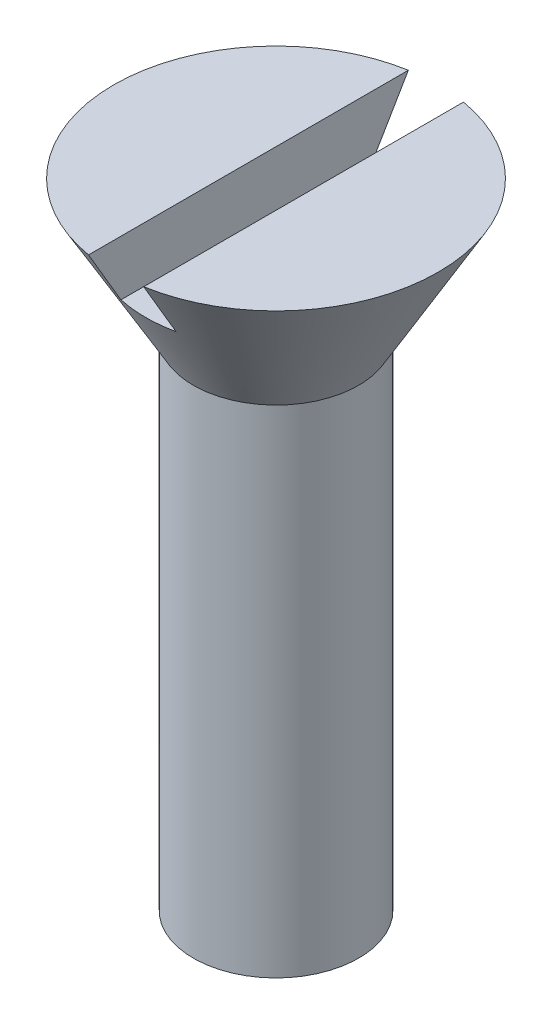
ISO-10303-21;
HEADER;
FILE_DESCRIPTION(('STEP AP214'),'2;1');
FILE_NAME('part.step','',(''),(''),'','','');
FILE_SCHEMA(('AUTOMOTIVE_DESIGN { 1 0 10303 214 1 1 1 1 }'));
ENDSEC;
DATA;
#1=APPLICATION_CONTEXT('core data for automotive mechanical design processes');
#2=APPLICATION_PROTOCOL_DEFINITION('international standard','automotive_design',2000,#1);
#3=PRODUCT_CONTEXT('',#1,'mechanical');
#4=PRODUCT('Part','Part','',(#3));
#5=PRODUCT_RELATED_PRODUCT_CATEGORY('part','',(#4));
#6=PRODUCT_DEFINITION_FORMATION('','',#4);
#7=PRODUCT_DEFINITION_CONTEXT('part definition',#1,'design');
#8=PRODUCT_DEFINITION('design','',#6,#7);
#9=PRODUCT_DEFINITION_SHAPE('','',#8);
#10=(LENGTH_UNIT() NAMED_UNIT(*) SI_UNIT(.MILLI.,.METRE.));
#11=(NAMED_UNIT(*) PLANE_ANGLE_UNIT() SI_UNIT($,.RADIAN.));
#12=(NAMED_UNIT(*) SI_UNIT($,.STERADIAN.) SOLID_ANGLE_UNIT());
#13=UNCERTAINTY_MEASURE_WITH_UNIT(LENGTH_MEASURE(1.E-05),#10,'distance_accuracy_value','');
#14=(GEOMETRIC_REPRESENTATION_CONTEXT(3) GLOBAL_UNCERTAINTY_ASSIGNED_CONTEXT((#13)) GLOBAL_UNIT_ASSIGNED_CONTEXT((#10,
#11,#12)) REPRESENTATION_CONTEXT('',''));
#15=CARTESIAN_POINT('',(0.,0.,0.));
#16=DIRECTION('',(0.,0.,1.));
#17=DIRECTION('',(1.,0.,0.));
#18=AXIS2_PLACEMENT_3D('',#15,#16,#17);
#19=CARTESIAN_POINT('',(5.88675134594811,24.7320508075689,0.));
#20=DIRECTION('',(0.,-1.,0.));
#21=DIRECTION('',(1.,0.,0.));
#22=AXIS2_PLACEMENT_3D('',#19,#20,#21);
#23=PLANE('',#22);
#24=CARTESIAN_POINT('',(0.,24.7320508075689,0.));
#25=DIRECTION('',(0.,1.,0.));
#26=DIRECTION('',(-1.,0.,0.));
#27=AXIS2_PLACEMENT_3D('',#24,#25,#26);
#28=CIRCLE('',#27,5.88675134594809);
#29=CARTESIAN_POINT('',(1.00000000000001,24.7320508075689,5.80119310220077));
#30=VERTEX_POINT('',#29);
#31=CARTESIAN_POINT('',(1.00000000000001,24.7320508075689,-5.80119310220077));
#32=VERTEX_POINT('',#31);
#33=EDGE_CURVE('E85',#30,#32,#28,.T.);
#34=ORIENTED_EDGE('',*,*,#33,.T.);
#35=DIRECTION('',(0.,0.,-1.));
#36=VECTOR('',#35,1.);
#37=CARTESIAN_POINT('',(1.00000000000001,24.7320508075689,7.20359485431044));
#38=LINE('',#37,#36);
#39=EDGE_CURVE('E78',#30,#32,#38,.T.);
#40=ORIENTED_EDGE('',*,*,#39,.F.);
#41=EDGE_LOOP('',(#34,#40));
#42=FACE_BOUND('',#41,.T.);
#43=ADVANCED_FACE('F32',(#42),#23,.F.);
#44=CARTESIAN_POINT('',(-1.00000000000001,24.7320508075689,-5.80119310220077));
#45=VERTEX_POINT('',#44);
#46=CARTESIAN_POINT('',(-0.999999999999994,24.7320508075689,5.80119310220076));
#47=VERTEX_POINT('',#46);
#48=EDGE_CURVE('E92',#45,#47,#28,.T.);
#49=ORIENTED_EDGE('',*,*,#48,.T.);
#50=DIRECTION('',(0.,0.,1.));
#51=VECTOR('',#50,1.);
#52=CARTESIAN_POINT('',(-0.999999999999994,24.7320508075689,7.20359485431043));
#53=LINE('',#52,#51);
#54=EDGE_CURVE('E86',#45,#47,#53,.T.);
#55=ORIENTED_EDGE('',*,*,#54,.F.);
#56=EDGE_LOOP('',(#49,#55));
#57=FACE_BOUND('',#56,.T.);
#58=ADVANCED_FACE('F34',(#57),#23,.F.);
#59=CARTESIAN_POINT('',(0.,19.7320508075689,0.));
#60=DIRECTION('',(0.,1.,0.));
#61=DIRECTION('',(-1.,0.,0.));
#62=AXIS2_PLACEMENT_3D('',#59,#60,#61);
#63=CONICAL_SURFACE('',#62,3.,0.523598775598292);
#64=ORIENTED_EDGE('',*,*,#33,.F.);
#65=CARTESIAN_POINT('',(1.,31.8975513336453,9.97374876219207));
#66=CARTESIAN_POINT('',(1.00000000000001,31.4187306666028,9.69591018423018));
#67=CARTESIAN_POINT('',(1.00000000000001,30.9399557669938,9.41799266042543));
#68=CARTESIAN_POINT('',(1.00000000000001,29.9825363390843,8.86193069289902));
#69=CARTESIAN_POINT('',(1.00000000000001,29.5038918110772,8.58378624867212));
#70=CARTESIAN_POINT('',(1.00000000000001,28.5466949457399,8.02715662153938));
#71=CARTESIAN_POINT('',(1.00000000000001,28.0681426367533,7.74867138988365));
#72=CARTESIAN_POINT('',(1.00000000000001,27.1112750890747,7.19129594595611));
#73=CARTESIAN_POINT('',(1.00000000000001,26.6329598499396,6.91240573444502));
#74=CARTESIAN_POINT('',(1.00000000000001,25.6710643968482,6.3507813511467));
#75=CARTESIAN_POINT('',(1.00000000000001,25.1874881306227,6.06804041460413));
#76=CARTESIAN_POINT('',(1.00000000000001,24.2208498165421,5.5016744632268));
#77=CARTESIAN_POINT('',(1.00000000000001,23.7377877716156,5.21804944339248));
#78=CARTESIAN_POINT('',(1.00000000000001,22.7725394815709,4.64944509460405));
#79=CARTESIAN_POINT('',(1.00000000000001,22.290353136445,4.36446593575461));
#80=CARTESIAN_POINT('',(1.00000000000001,21.568172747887,3.93515286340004));
#81=CARTESIAN_POINT('',(1.00000000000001,21.3276303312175,3.79174183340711));
#82=CARTESIAN_POINT('',(1.00000000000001,20.8470636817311,3.50405412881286));
#83=CARTESIAN_POINT('',(1.,20.6070394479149,3.35977745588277));
#84=CARTESIAN_POINT('',(1.,20.1297110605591,3.07116716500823));
#85=CARTESIAN_POINT('',(1.00000000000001,19.892400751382,2.92684373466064));
#86=CARTESIAN_POINT('',(1.00000000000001,19.4188603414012,2.63632771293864));
#87=CARTESIAN_POINT('',(1.00000000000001,19.1826304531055,2.49013477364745));
#88=CARTESIAN_POINT('',(1.00000000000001,18.8300575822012,2.26879280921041));
#89=CARTESIAN_POINT('',(1.00000000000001,18.7130010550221,2.19478142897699));
#90=CARTESIAN_POINT('',(1.00000000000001,18.4795317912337,2.04575133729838));
#91=CARTESIAN_POINT('',(1.00000000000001,18.3631190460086,1.97073263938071));
#92=CARTESIAN_POINT('',(1.00000000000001,18.1312259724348,1.8193519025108));
#93=CARTESIAN_POINT('',(1.00000000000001,18.0157453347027,1.74299033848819));
#94=CARTESIAN_POINT('',(1.00000000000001,17.78608351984,1.58834232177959));
#95=CARTESIAN_POINT('',(1.,17.671902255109,1.51005599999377));
#96=CARTESIAN_POINT('',(1.00000000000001,17.4812521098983,1.37574539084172));
#97=CARTESIAN_POINT('',(1.00000000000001,17.4042460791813,1.32048649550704));
#98=CARTESIAN_POINT('',(1.00000000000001,17.2515550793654,1.20809051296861));
#99=CARTESIAN_POINT('',(1.00000000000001,17.1758707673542,1.15095253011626));
#100=CARTESIAN_POINT('',(1.00000000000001,17.0260281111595,1.03368691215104));
#101=CARTESIAN_POINT('',(1.00000000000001,16.9518828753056,0.973542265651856));
#102=CARTESIAN_POINT('',(1.00000000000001,16.8432199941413,0.880395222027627));
#103=CARTESIAN_POINT('',(1.00000000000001,16.8074385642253,0.848870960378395));
#104=CARTESIAN_POINT('',(1.00000000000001,16.7370055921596,0.784589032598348));
#105=CARTESIAN_POINT('',(1.,16.7023538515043,0.75183158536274));
#106=CARTESIAN_POINT('',(1.,16.6339767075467,0.684163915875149));
#107=CARTESIAN_POINT('',(1.00000000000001,16.6002786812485,0.649225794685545));
#108=CARTESIAN_POINT('',(1.00000000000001,16.5351561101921,0.577307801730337));
#109=CARTESIAN_POINT('',(1.00000000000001,16.5037299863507,0.540329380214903));
#110=CARTESIAN_POINT('',(1.00000000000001,16.4445095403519,0.464128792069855));
#111=CARTESIAN_POINT('',(1.00000000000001,16.4166815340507,0.424933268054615));
#112=CARTESIAN_POINT('',(1.00000000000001,16.3660815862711,0.343457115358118));
#113=CARTESIAN_POINT('',(1.00000000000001,16.3432939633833,0.301186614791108));
#114=CARTESIAN_POINT('',(1.00000000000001,16.3089887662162,0.22165390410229));
#115=CARTESIAN_POINT('',(1.00000000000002,16.2961494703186,0.184979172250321));
#116=CARTESIAN_POINT('',(1.00000000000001,16.2772108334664,0.109948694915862));
#117=CARTESIAN_POINT('',(0.999999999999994,16.2710939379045,0.0715976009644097));
#118=CARTESIAN_POINT('',(0.999999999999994,16.2666765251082,-0.00583623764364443));
#119=CARTESIAN_POINT('',(1.00000000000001,16.268428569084,-0.0449221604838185));
#120=CARTESIAN_POINT('',(1.00000000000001,16.2795188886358,-0.12203468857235));
#121=CARTESIAN_POINT('',(1.,16.2888754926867,-0.160058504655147));
#122=CARTESIAN_POINT('',(0.999999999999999,16.3171159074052,-0.244440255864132));
#123=CARTESIAN_POINT('',(1.00000000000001,16.337942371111,-0.290124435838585));
#124=CARTESIAN_POINT('',(1.00000000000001,16.3860855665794,-0.377905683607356));
#125=CARTESIAN_POINT('',(1.,16.4134202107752,-0.419992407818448));
#126=CARTESIAN_POINT('',(1.,16.4652302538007,-0.4914852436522));
#127=CARTESIAN_POINT('',(1.00000000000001,16.4888457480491,-0.521531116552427));
#128=CARTESIAN_POINT('',(1.00000000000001,16.5378411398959,-0.5801578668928));
#129=CARTESIAN_POINT('',(1.00000000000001,16.5632217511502,-0.608738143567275));
#130=CARTESIAN_POINT('',(1.00000000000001,16.6413943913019,-0.692790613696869));
#131=CARTESIAN_POINT('',(1.00000000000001,16.696122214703,-0.746451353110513));
#132=CARTESIAN_POINT('',(1.00000000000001,16.8089714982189,-0.85085067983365));
#133=CARTESIAN_POINT('',(1.00000000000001,16.8671149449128,-0.901564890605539));
#134=CARTESIAN_POINT('',(1.00000000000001,16.9557668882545,-0.975827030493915));
#135=CARTESIAN_POINT('',(1.00000000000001,16.985536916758,-1.0002640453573));
#136=CARTESIAN_POINT('',(1.00000000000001,17.0454845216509,-1.0486307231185));
#137=CARTESIAN_POINT('',(1.00000000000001,17.0756620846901,-1.07256040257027));
#138=CARTESIAN_POINT('',(1.00000000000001,17.1773927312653,-1.15206390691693));
#139=CARTESIAN_POINT('',(1.00000000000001,17.2497060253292,-1.20666482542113));
#140=CARTESIAN_POINT('',(1.00000000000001,17.3955854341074,-1.31417121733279));
#141=CARTESIAN_POINT('',(1.00000000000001,17.4691517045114,-1.367076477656));
#142=CARTESIAN_POINT('',(1.00000000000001,17.6172040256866,-1.4716391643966));
#143=CARTESIAN_POINT('',(1.00000000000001,17.69169040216,-1.52329612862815));
#144=CARTESIAN_POINT('',(1.00000000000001,17.8413280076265,-1.62563941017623));
#145=CARTESIAN_POINT('',(1.00000000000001,17.9164792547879,-1.67632570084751));
#146=CARTESIAN_POINT('',(1.00000000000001,18.1429265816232,-1.82741818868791));
#147=CARTESIAN_POINT('',(1.00000000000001,18.2949776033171,-1.92669179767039));
#148=CARTESIAN_POINT('',(1.00000000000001,18.6002892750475,-2.12327464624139));
#149=CARTESIAN_POINT('',(1.00000000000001,18.7535496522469,-2.22058431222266));
#150=CARTESIAN_POINT('',(1.00000000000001,19.0601638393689,-2.41338835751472));
#151=CARTESIAN_POINT('',(1.00000000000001,19.2135135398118,-2.50888928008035));
#152=CARTESIAN_POINT('',(1.00000000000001,19.5208119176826,-2.69894010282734));
#153=CARTESIAN_POINT('',(1.00000000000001,19.6747606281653,-2.7934899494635));
#154=CARTESIAN_POINT('',(1.00000000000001,19.9829563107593,-2.98179376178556));
#155=CARTESIAN_POINT('',(1.00000000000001,20.1372028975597,-3.07554835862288));
#156=CARTESIAN_POINT('',(1.00000000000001,20.446022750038,-3.26251114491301));
#157=CARTESIAN_POINT('',(1.,20.6005960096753,-3.35571934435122));
#158=CARTESIAN_POINT('',(0.999999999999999,20.985391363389,-3.58703363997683));
#159=CARTESIAN_POINT('',(1.00000000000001,21.2157679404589,-3.72488267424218));
#160=CARTESIAN_POINT('',(1.00000000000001,21.6769231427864,-3.99990685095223));
#161=CARTESIAN_POINT('',(1.00000000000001,21.9077017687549,-4.13708199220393));
#162=CARTESIAN_POINT('',(1.00000000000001,22.6004825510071,-4.54786879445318));
#163=CARTESIAN_POINT('',(1.00000000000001,23.0629243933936,-4.82073870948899));
#164=CARTESIAN_POINT('',(1.00000000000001,23.9886821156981,-5.36542115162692));
#165=CARTESIAN_POINT('',(1.00000000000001,24.451998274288,-5.63723320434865));
#166=CARTESIAN_POINT('',(1.00000000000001,25.379075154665,-6.18009259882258));
#167=CARTESIAN_POINT('',(1.00000000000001,25.8428358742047,-6.45113994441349));
#168=CARTESIAN_POINT('',(1.00000000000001,26.7723337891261,-6.99369062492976));
#169=CARTESIAN_POINT('',(1.00000000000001,27.238072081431,-7.26519207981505));
#170=CARTESIAN_POINT('',(1.00000000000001,28.1697675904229,-7.80782084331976));
#171=CARTESIAN_POINT('',(1.00000000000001,28.6357248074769,-8.07894815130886));
#172=CARTESIAN_POINT('',(1.00000000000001,29.5675917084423,-8.62080676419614));
#173=CARTESIAN_POINT('',(1.00000000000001,30.0335013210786,-8.89153819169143));
#174=CARTESIAN_POINT('',(1.00000000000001,30.9654431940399,-9.43278774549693));
#175=CARTESIAN_POINT('',(1.00000000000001,31.4314754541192,-9.70330587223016));
#176=CARTESIAN_POINT('',(1.,31.8975513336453,-9.97374876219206));
#177=B_SPLINE_CURVE_WITH_KNOTS('',3,(#65,#66,#67,#68,#69,#70,#71,#72,#73,#74,#75,#76,#77,#78,
#79,#80,#81,#82,#83,#84,#85,#86,#87,#88,#89,#90,#91,#92,#93,#94,#95,#96,#97,#98,#99,#100,#101,
#102,#103,#104,#105,#106,#107,#108,#109,#110,#111,#112,#113,#114,#115,#116,#117,#118,#119,#120,
#121,#122,#123,#124,#125,#126,#127,#128,#129,#130,#131,#132,#133,#134,#135,#136,#137,#138,#139,
#140,#141,#142,#143,#144,#145,#146,#147,#148,#149,#150,#151,#152,#153,#154,#155,#156,#157,#158,
#159,#160,#161,#162,#163,#164,#165,#166,#167,#168,#169,#170,#171,#172,#173,#174,#175,#176),
.UNSPECIFIED.,.F.,.F.,(4,2,2,2,2,2,2,2,2,2,2,2,2,2,2,2,2,2,2,2,2,2,2,2,2,2,2,2,2,2,2,2,2,2,2,2,
2,2,2,2,2,2,2,2,2,2,2,2,2,2,2,2,2,2,2,4),(0.,1.66077443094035,3.32155256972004,4.98260540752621,
6.64365512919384,8.32415911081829,10.0046726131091,11.6849803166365,12.5251258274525,
13.3652697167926,14.1985176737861,15.0319230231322,15.4473941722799,15.8628597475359,
16.2781812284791,16.6934745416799,16.9777975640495,17.2622581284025,17.5485667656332,
17.6916075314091,17.8346230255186,17.9801781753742,18.1256311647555,18.2696049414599,
18.413124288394,18.5292057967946,18.6449834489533,18.7615355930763,18.8783694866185,
19.0281520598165,19.1783517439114,19.2929216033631,19.4075380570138,19.6372353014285,
19.8686208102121,19.9841614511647,20.0996983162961,20.3714921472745,20.6433200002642,
20.9152470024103,21.187181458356,21.7319226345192,22.2765442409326,22.8185068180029,
23.3604997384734,23.9020122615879,24.4435148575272,25.2489207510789,26.054328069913,
27.6651609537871,29.2766479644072,30.8881268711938,32.5054166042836,34.1227090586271,
35.7392811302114,37.3558499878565),.UNSPECIFIED.);
#178=CARTESIAN_POINT('',(1.00000000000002,22.7320508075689,4.62518160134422));
#179=VERTEX_POINT('',#178);
#180=EDGE_CURVE('E11',#30,#179,#177,.T.);
#181=ORIENTED_EDGE('',*,*,#180,.T.);
#182=CARTESIAN_POINT('',(0.,22.7320508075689,0.));
#183=DIRECTION('',(0.,-1.,0.));
#184=DIRECTION('',(0.,0.,-1.));
#185=AXIS2_PLACEMENT_3D('',#182,#183,#184);
#186=CIRCLE('',#185,4.73205080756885);
#187=CARTESIAN_POINT('',(-0.999999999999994,22.7320508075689,4.62518160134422));
#188=VERTEX_POINT('',#187);
#189=EDGE_CURVE('E96',#179,#188,#186,.T.);
#190=ORIENTED_EDGE('',*,*,#189,.T.);
#191=CARTESIAN_POINT('',(-0.999999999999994,31.8975513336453,-9.97374876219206));
#192=CARTESIAN_POINT('',(-0.999999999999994,31.4187306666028,-9.69591018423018));
#193=CARTESIAN_POINT('',(-0.999999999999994,30.9399557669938,-9.41799266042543));
#194=CARTESIAN_POINT('',(-0.999999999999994,29.9825363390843,-8.86193069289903));
#195=CARTESIAN_POINT('',(-0.999999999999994,29.5038918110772,-8.58378624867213));
#196=CARTESIAN_POINT('',(-0.999999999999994,28.5466949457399,-8.02715662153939));
#197=CARTESIAN_POINT('',(-0.999999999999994,28.0681426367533,-7.74867138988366));
#198=CARTESIAN_POINT('',(-0.999999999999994,27.1112750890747,-7.19129594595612));
#199=CARTESIAN_POINT('',(-0.999999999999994,26.6329598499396,-6.91240573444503));
#200=CARTESIAN_POINT('',(-0.999999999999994,25.6710643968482,-6.35078135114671));
#201=CARTESIAN_POINT('',(-0.999999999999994,25.1874881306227,-6.06804041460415));
#202=CARTESIAN_POINT('',(-0.999999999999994,24.2208498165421,-5.50167446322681));
#203=CARTESIAN_POINT('',(-0.999999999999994,23.7377877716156,-5.21804944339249));
#204=CARTESIAN_POINT('',(-0.999999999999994,22.7725394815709,-4.64944509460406));
#205=CARTESIAN_POINT('',(-0.999999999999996,22.290353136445,-4.36446593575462));
#206=CARTESIAN_POINT('',(-0.999999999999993,21.568172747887,-3.93515286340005));
#207=CARTESIAN_POINT('',(-0.999999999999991,21.3276303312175,-3.79174183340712));
#208=CARTESIAN_POINT('',(-0.999999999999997,20.8470636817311,-3.50405412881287));
#209=CARTESIAN_POINT('',(-1.,20.6070394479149,-3.35977745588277));
#210=CARTESIAN_POINT('',(-1.,20.1297110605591,-3.07116716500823));
#211=CARTESIAN_POINT('',(-0.999999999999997,19.892400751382,-2.92684373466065));
#212=CARTESIAN_POINT('',(-0.999999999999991,19.4188603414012,-2.63632771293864));
#213=CARTESIAN_POINT('',(-0.999999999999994,19.1826304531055,-2.49013477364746));
#214=CARTESIAN_POINT('',(-0.999999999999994,18.8300575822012,-2.26879280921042));
#215=CARTESIAN_POINT('',(-0.999999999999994,18.7130010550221,-2.19478142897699));
#216=CARTESIAN_POINT('',(-0.999999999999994,18.4795317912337,-2.04575133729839));
#217=CARTESIAN_POINT('',(-0.999999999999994,18.3631190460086,-1.97073263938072));
#218=CARTESIAN_POINT('',(-0.999999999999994,18.1312259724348,-1.81935190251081));
#219=CARTESIAN_POINT('',(-0.999999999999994,18.0157453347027,-1.7429903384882));
#220=CARTESIAN_POINT('',(-0.999999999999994,17.78608351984,-1.5883423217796));
#221=CARTESIAN_POINT('',(-0.999999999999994,17.671902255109,-1.51005599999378));
#222=CARTESIAN_POINT('',(-0.999999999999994,17.4812521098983,-1.37574539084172));
#223=CARTESIAN_POINT('',(-0.999999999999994,17.4042460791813,-1.32048649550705));
#224=CARTESIAN_POINT('',(-0.999999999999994,17.2515550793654,-1.20809051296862));
#225=CARTESIAN_POINT('',(-0.999999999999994,17.1758707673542,-1.15095253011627));
#226=CARTESIAN_POINT('',(-0.999999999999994,17.0260281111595,-1.03368691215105));
#227=CARTESIAN_POINT('',(-0.999999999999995,16.9518828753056,-0.973542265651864));
#228=CARTESIAN_POINT('',(-0.999999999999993,16.8432199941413,-0.88039522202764));
#229=CARTESIAN_POINT('',(-0.999999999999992,16.8074385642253,-0.848870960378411));
#230=CARTESIAN_POINT('',(-0.999999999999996,16.7370055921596,-0.784589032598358));
#231=CARTESIAN_POINT('',(-1.,16.7023538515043,-0.751831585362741));
#232=CARTESIAN_POINT('',(-1.,16.6339767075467,-0.684163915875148));
#233=CARTESIAN_POINT('',(-0.999999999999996,16.6002786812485,-0.649225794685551));
#234=CARTESIAN_POINT('',(-0.999999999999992,16.5351561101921,-0.577307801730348));
#235=CARTESIAN_POINT('',(-0.999999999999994,16.5037299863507,-0.540329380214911));
#236=CARTESIAN_POINT('',(-0.999999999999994,16.4445095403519,-0.464128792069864));
#237=CARTESIAN_POINT('',(-0.999999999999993,16.4166815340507,-0.424933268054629));
#238=CARTESIAN_POINT('',(-0.999999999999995,16.3660815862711,-0.343457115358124));
#239=CARTESIAN_POINT('',(-0.999999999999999,16.3432939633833,-0.301186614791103));
#240=CARTESIAN_POINT('',(-0.999999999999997,16.3089887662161,-0.22165390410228));
#241=CARTESIAN_POINT('',(-0.999999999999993,16.2961494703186,-0.184979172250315));
#242=CARTESIAN_POINT('',(-0.999999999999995,16.2772108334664,-0.109948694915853));
#243=CARTESIAN_POINT('',(-1.,16.2710939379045,-0.071597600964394));
#244=CARTESIAN_POINT('',(-1.,16.2666765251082,0.0058362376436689));
#245=CARTESIAN_POINT('',(-0.999999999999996,16.268428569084,0.044922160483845));
#246=CARTESIAN_POINT('',(-0.999999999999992,16.2795188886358,0.122034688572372));
#247=CARTESIAN_POINT('',(-0.999999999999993,16.2888754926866,0.160058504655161));
#248=CARTESIAN_POINT('',(-0.999999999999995,16.3171159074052,0.244440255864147));
#249=CARTESIAN_POINT('',(-0.999999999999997,16.337942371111,0.290124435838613));
#250=CARTESIAN_POINT('',(-0.999999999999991,16.3860855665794,0.377905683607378));
#251=CARTESIAN_POINT('',(-0.999999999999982,16.4134202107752,0.419992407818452));
#252=CARTESIAN_POINT('',(-0.999999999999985,16.4652302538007,0.491485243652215));
#253=CARTESIAN_POINT('',(-0.999999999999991,16.4888457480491,0.52153111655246));
#254=CARTESIAN_POINT('',(-0.999999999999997,16.5378411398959,0.580157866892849));
#255=CARTESIAN_POINT('',(-0.999999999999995,16.5632217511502,0.608738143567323));
#256=CARTESIAN_POINT('',(-0.999999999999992,16.6413943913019,0.692790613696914));
#257=CARTESIAN_POINT('',(-0.999999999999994,16.696122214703,0.746451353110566));
#258=CARTESIAN_POINT('',(-0.999999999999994,16.808971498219,0.850850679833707));
#259=CARTESIAN_POINT('',(-0.999999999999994,16.8671149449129,0.901564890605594));
#260=CARTESIAN_POINT('',(-0.999999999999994,16.9557668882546,0.975827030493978));
#261=CARTESIAN_POINT('',(-0.999999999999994,16.9855369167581,1.00026404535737));
#262=CARTESIAN_POINT('',(-0.999999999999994,17.045484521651,1.04863072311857));
#263=CARTESIAN_POINT('',(-0.999999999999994,17.0756620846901,1.07256040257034));
#264=CARTESIAN_POINT('',(-0.999999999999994,17.1773927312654,1.15206390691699));
#265=CARTESIAN_POINT('',(-0.999999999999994,17.2497060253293,1.20666482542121));
#266=CARTESIAN_POINT('',(-0.999999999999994,17.3955854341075,1.31417121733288));
#267=CARTESIAN_POINT('',(-0.999999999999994,17.4691517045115,1.3670764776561));
#268=CARTESIAN_POINT('',(-0.999999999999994,17.6172040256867,1.4716391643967));
#269=CARTESIAN_POINT('',(-0.999999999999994,17.6916904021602,1.52329612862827));
#270=CARTESIAN_POINT('',(-0.999999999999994,17.8413280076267,1.62563941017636));
#271=CARTESIAN_POINT('',(-0.999999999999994,17.916479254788,1.67632570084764));
#272=CARTESIAN_POINT('',(-0.999999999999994,18.1429265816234,1.82741818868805));
#273=CARTESIAN_POINT('',(-0.999999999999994,18.2949776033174,1.92669179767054));
#274=CARTESIAN_POINT('',(-0.999999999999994,18.6002892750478,2.12327464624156));
#275=CARTESIAN_POINT('',(-0.999999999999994,18.7535496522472,2.22058431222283));
#276=CARTESIAN_POINT('',(-0.999999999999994,19.0601638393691,2.41338835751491));
#277=CARTESIAN_POINT('',(-0.999999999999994,19.2135135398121,2.50888928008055));
#278=CARTESIAN_POINT('',(-0.999999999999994,19.5208119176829,2.69894010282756));
#279=CARTESIAN_POINT('',(-0.999999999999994,19.6747606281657,2.79348994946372));
#280=CARTESIAN_POINT('',(-0.999999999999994,19.9829563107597,2.9817937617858));
#281=CARTESIAN_POINT('',(-0.999999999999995,20.1372028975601,3.07554835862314));
#282=CARTESIAN_POINT('',(-0.999999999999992,20.4460227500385,3.26251114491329));
#283=CARTESIAN_POINT('',(-0.999999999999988,20.6005960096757,3.35571934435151));
#284=CARTESIAN_POINT('',(-0.999999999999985,20.9853913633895,3.58703363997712));
#285=CARTESIAN_POINT('',(-0.999999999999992,21.2157679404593,3.72488267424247));
#286=CARTESIAN_POINT('',(-0.999999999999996,21.6769231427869,3.9999068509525));
#287=CARTESIAN_POINT('',(-0.999999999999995,21.9077017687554,4.13708199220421));
#288=CARTESIAN_POINT('',(-0.999999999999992,22.6004825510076,4.54786879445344));
#289=CARTESIAN_POINT('',(-0.999999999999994,23.062924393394,4.82073870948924));
#290=CARTESIAN_POINT('',(-0.999999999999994,23.9886821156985,5.36542115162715));
#291=CARTESIAN_POINT('',(-0.999999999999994,24.4519982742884,5.63723320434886));
#292=CARTESIAN_POINT('',(-0.999999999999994,25.3790751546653,6.18009259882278));
#293=CARTESIAN_POINT('',(-0.999999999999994,25.842835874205,6.45113994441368));
#294=CARTESIAN_POINT('',(-0.999999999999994,26.7723337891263,6.99369062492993));
#295=CARTESIAN_POINT('',(-0.999999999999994,27.2380720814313,7.2651920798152));
#296=CARTESIAN_POINT('',(-0.999999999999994,28.1697675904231,7.80782084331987));
#297=CARTESIAN_POINT('',(-0.999999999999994,28.6357248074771,8.07894815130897));
#298=CARTESIAN_POINT('',(-0.999999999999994,29.5675917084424,8.62080676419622));
#299=CARTESIAN_POINT('',(-0.999999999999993,30.0335013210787,8.89153819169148));
#300=CARTESIAN_POINT('',(-0.999999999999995,30.9654431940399,9.43278774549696));
#301=CARTESIAN_POINT('',(-0.999999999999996,31.4314754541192,9.70330587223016));
#302=CARTESIAN_POINT('',(-1.,31.8975513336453,9.97374876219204));
#303=B_SPLINE_CURVE_WITH_KNOTS('',3,(#191,#192,#193,#194,#195,#196,#197,#198,#199,#200,#201,
#202,#203,#204,#205,#206,#207,#208,#209,#210,#211,#212,#213,#214,#215,#216,#217,#218,#219,#220,
#221,#222,#223,#224,#225,#226,#227,#228,#229,#230,#231,#232,#233,#234,#235,#236,#237,#238,#239,
#240,#241,#242,#243,#244,#245,#246,#247,#248,#249,#250,#251,#252,#253,#254,#255,#256,#257,#258,
#259,#260,#261,#262,#263,#264,#265,#266,#267,#268,#269,#270,#271,#272,#273,#274,#275,#276,#277,
#278,#279,#280,#281,#282,#283,#284,#285,#286,#287,#288,#289,#290,#291,#292,#293,#294,#295,#296,
#297,#298,#299,#300,#301,#302),.UNSPECIFIED.,.F.,.F.,(4,2,2,2,2,2,2,2,2,2,2,2,2,2,2,2,2,2,2,2,2,
2,2,2,2,2,2,2,2,2,2,2,2,2,2,2,2,2,2,2,2,2,2,2,2,2,2,2,2,2,2,2,2,2,2,4),(0.,1.66077443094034,
3.32155256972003,4.98260540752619,6.64365512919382,8.32415911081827,10.0046726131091,
11.6849803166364,12.5251258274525,13.3652697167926,14.1985176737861,15.0319230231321,
15.4473941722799,15.8628597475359,16.2781812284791,16.6934745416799,16.9777975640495,
17.2622581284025,17.5485667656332,17.6916075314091,17.8346230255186,17.9801781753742,
18.1256311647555,18.2696049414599,18.413124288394,18.5292057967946,18.6449834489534,
18.7615355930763,18.8783694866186,19.0281520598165,19.1783517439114,19.2929216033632,
19.4075380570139,19.6372353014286,19.8686208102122,19.9841614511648,20.0996983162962,
20.3714921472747,20.6433200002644,20.9152470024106,21.1871814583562,21.7319226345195,
22.276544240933,22.8185068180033,23.3604997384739,23.9020122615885,24.4435148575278,
25.2489207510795,26.0543280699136,27.6651609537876,29.2766479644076,30.8881268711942,
32.5054166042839,34.1227090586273,35.7392811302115,37.3558499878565),.UNSPECIFIED.);
#304=EDGE_CURVE('E45',#188,#47,#303,.T.);
#305=ORIENTED_EDGE('',*,*,#304,.T.);
#306=ORIENTED_EDGE('',*,*,#48,.F.);
#307=CARTESIAN_POINT('',(-1.,22.7320508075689,-4.62518160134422));
#308=VERTEX_POINT('',#307);
#309=EDGE_CURVE('E94',#45,#308,#303,.T.);
#310=ORIENTED_EDGE('',*,*,#309,.T.);
#311=CARTESIAN_POINT('',(1.,22.7320508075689,-4.62518160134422));
#312=VERTEX_POINT('',#311);
#313=EDGE_CURVE('E91',#308,#312,#186,.T.);
#314=ORIENTED_EDGE('',*,*,#313,.T.);
#315=EDGE_CURVE('E36',#312,#32,#177,.T.);
#316=ORIENTED_EDGE('',*,*,#315,.T.);
#317=EDGE_LOOP('',(#64,#181,#190,#305,#306,#310,#314,#316));
#318=FACE_BOUND('',#317,.T.);
#319=CARTESIAN_POINT('',(0.,19.7320508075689,0.));
#320=DIRECTION('',(0.,1.,0.));
#321=DIRECTION('',(-1.,0.,0.));
#322=AXIS2_PLACEMENT_3D('',#319,#320,#321);
#323=CIRCLE('',#322,3.);
#324=CARTESIAN_POINT('',(-3.00000000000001,19.7320508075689,0.));
#325=VERTEX_POINT('',#324);
#326=EDGE_CURVE('E98',#325,#325,#323,.T.);
#327=ORIENTED_EDGE('',*,*,#326,.T.);
#328=EDGE_LOOP('',(#327));
#329=FACE_BOUND('',#328,.T.);
#330=ADVANCED_FACE('F88',(#318,#329),#63,.T.);
#331=CARTESIAN_POINT('',(0.,37.31315003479,0.));
#332=DIRECTION('',(0.,1.,0.));
#333=DIRECTION('',(-1.,0.,0.));
#334=AXIS2_PLACEMENT_3D('',#331,#332,#333);
#335=CYLINDRICAL_SURFACE('',#334,3.);
#336=ORIENTED_EDGE('',*,*,#326,.F.);
#337=EDGE_LOOP('',(#336));
#338=FACE_BOUND('',#337,.T.);
#339=CARTESIAN_POINT('',(0.,1.7320508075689,0.));
#340=DIRECTION('',(0.,1.,0.));
#341=DIRECTION('',(-1.,0.,0.));
#342=AXIS2_PLACEMENT_3D('',#339,#340,#341);
#343=CIRCLE('',#342,3.);
#344=CARTESIAN_POINT('',(-3.00000000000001,1.7320508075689,0.));
#345=VERTEX_POINT('',#344);
#346=EDGE_CURVE('E141',#345,#345,#343,.T.);
#347=ORIENTED_EDGE('',*,*,#346,.T.);
#348=EDGE_LOOP('',(#347));
#349=FACE_BOUND('',#348,.T.);
#350=ADVANCED_FACE('F119',(#338,#349),#335,.T.);
#351=CARTESIAN_POINT('',(0.,0.,0.));
#352=DIRECTION('',(0.,1.,0.));
#353=DIRECTION('',(-1.,0.,0.));
#354=AXIS2_PLACEMENT_3D('',#351,#352,#353);
#355=CONICAL_SURFACE('',#354,0.,1.04719755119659);
#356=ORIENTED_EDGE('',*,*,#346,.F.);
#357=EDGE_LOOP('',(#356));
#358=FACE_BOUND('',#357,.T.);
#359=CARTESIAN_POINT('',(0.,0.,0.));
#360=VERTEX_POINT('',#359);
#361=VERTEX_LOOP('',#360);
#362=FACE_BOUND('',#361,.T.);
#363=ADVANCED_FACE('F117',(#358,#362),#355,.T.);
#364=CARTESIAN_POINT('',(1.00000000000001,22.7320508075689,7.20359485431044));
#365=DIRECTION('',(1.,0.,0.));
#366=DIRECTION('',(0.,1.,0.));
#367=AXIS2_PLACEMENT_3D('',#364,#365,#366);
#368=PLANE('',#367);
#369=ORIENTED_EDGE('',*,*,#39,.T.);
#370=ORIENTED_EDGE('',*,*,#315,.F.);
#371=DIRECTION('',(0.,0.,-1.));
#372=VECTOR('',#371,1.);
#373=CARTESIAN_POINT('',(1.00000000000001,22.7320508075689,7.20359485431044));
#374=LINE('',#373,#372);
#375=EDGE_CURVE('E52',#179,#312,#374,.T.);
#376=ORIENTED_EDGE('',*,*,#375,.F.);
#377=ORIENTED_EDGE('',*,*,#180,.F.);
#378=EDGE_LOOP('',(#369,#370,#376,#377));
#379=FACE_BOUND('',#378,.T.);
#380=ADVANCED_FACE('F77',(#379),#368,.F.);
#381=CARTESIAN_POINT('',(-0.999999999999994,22.7320508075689,7.20359485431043));
#382=DIRECTION('',(-1.,0.,0.));
#383=DIRECTION('',(0.,-1.,0.));
#384=AXIS2_PLACEMENT_3D('',#381,#382,#383);
#385=PLANE('',#384);
#386=ORIENTED_EDGE('',*,*,#54,.T.);
#387=ORIENTED_EDGE('',*,*,#304,.F.);
#388=DIRECTION('',(0.,0.,1.));
#389=VECTOR('',#388,1.);
#390=CARTESIAN_POINT('',(-0.999999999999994,22.7320508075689,7.20359485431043));
#391=LINE('',#390,#389);
#392=EDGE_CURVE('E140',#308,#188,#391,.T.);
#393=ORIENTED_EDGE('',*,*,#392,.F.);
#394=ORIENTED_EDGE('',*,*,#309,.F.);
#395=EDGE_LOOP('',(#386,#387,#393,#394));
#396=FACE_BOUND('',#395,.T.);
#397=ADVANCED_FACE('F108',(#396),#385,.F.);
#398=CARTESIAN_POINT('',(1.,22.7320508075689,-7.20359485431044));
#399=DIRECTION('',(0.,-1.,0.));
#400=DIRECTION('',(0.,0.,-1.));
#401=AXIS2_PLACEMENT_3D('',#398,#399,#400);
#402=PLANE('',#401);
#403=ORIENTED_EDGE('',*,*,#375,.T.);
#404=ORIENTED_EDGE('',*,*,#313,.F.);
#405=ORIENTED_EDGE('',*,*,#392,.T.);
#406=ORIENTED_EDGE('',*,*,#189,.F.);
#407=EDGE_LOOP('',(#403,#404,#405,#406));
#408=FACE_BOUND('',#407,.T.);
#409=ADVANCED_FACE('F112',(#408),#402,.F.);
#410=CLOSED_SHELL('',(#43,#58,#330,#350,#363,#380,#397,#409));
#411=MANIFOLD_SOLID_BREP('B2',#410);
#412=ADVANCED_BREP_SHAPE_REPRESENTATION('',(#18,#411),#14);
#413=SHAPE_DEFINITION_REPRESENTATION(#9,#412);
ENDSEC;
END-ISO-10303-21;
